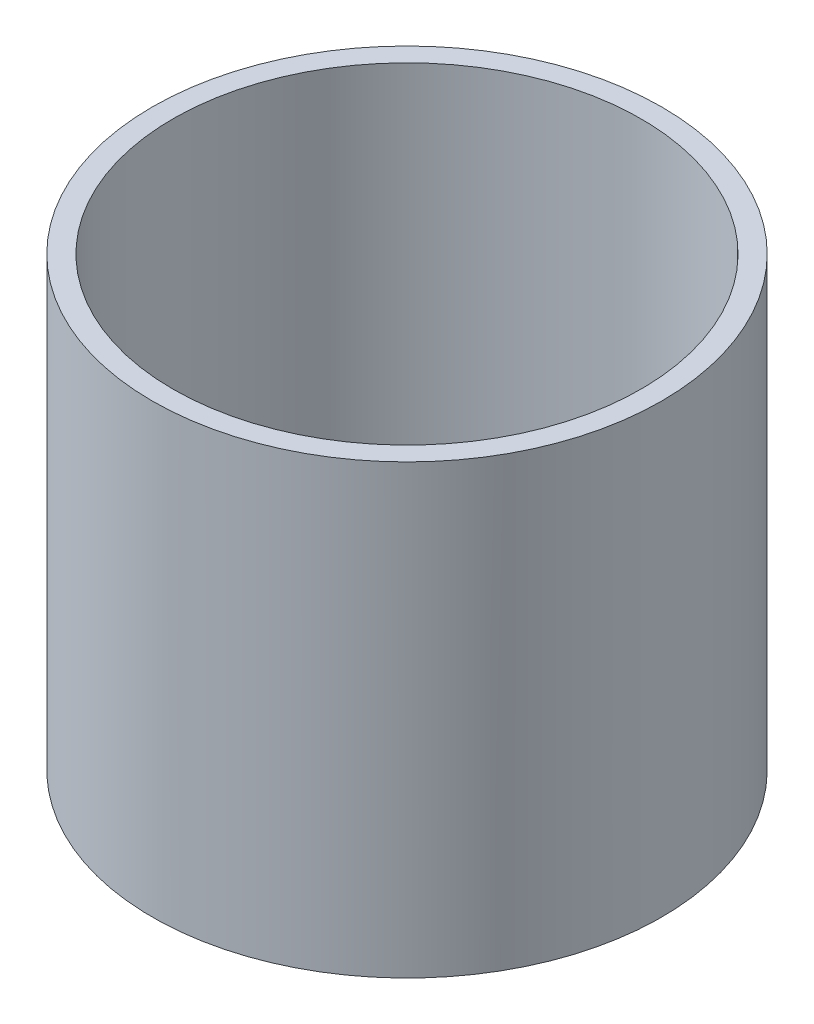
ISO-10303-21;
HEADER;
FILE_DESCRIPTION(('STEP AP214'),'2;1');
FILE_NAME('part.step','',(''),(''),'','','');
FILE_SCHEMA(('AUTOMOTIVE_DESIGN { 1 0 10303 214 1 1 1 1 }'));
ENDSEC;
DATA;
#1=APPLICATION_CONTEXT('core data for automotive mechanical design processes');
#2=APPLICATION_PROTOCOL_DEFINITION('international standard','automotive_design',2000,#1);
#3=PRODUCT_CONTEXT('',#1,'mechanical');
#4=PRODUCT('Part','Part','',(#3));
#5=PRODUCT_RELATED_PRODUCT_CATEGORY('part','',(#4));
#6=PRODUCT_DEFINITION_FORMATION('','',#4);
#7=PRODUCT_DEFINITION_CONTEXT('part definition',#1,'design');
#8=PRODUCT_DEFINITION('design','',#6,#7);
#9=PRODUCT_DEFINITION_SHAPE('','',#8);
#10=(LENGTH_UNIT() NAMED_UNIT(*) SI_UNIT(.MILLI.,.METRE.));
#11=(NAMED_UNIT(*) PLANE_ANGLE_UNIT() SI_UNIT($,.RADIAN.));
#12=(NAMED_UNIT(*) SI_UNIT($,.STERADIAN.) SOLID_ANGLE_UNIT());
#13=UNCERTAINTY_MEASURE_WITH_UNIT(LENGTH_MEASURE(1.E-05),#10,'distance_accuracy_value','');
#14=(GEOMETRIC_REPRESENTATION_CONTEXT(3) GLOBAL_UNCERTAINTY_ASSIGNED_CONTEXT((#13)) GLOBAL_UNIT_ASSIGNED_CONTEXT((#10,
#11,#12)) REPRESENTATION_CONTEXT('',''));
#15=CARTESIAN_POINT('',(0.,0.,0.));
#16=DIRECTION('',(0.,0.,1.));
#17=DIRECTION('',(1.,0.,0.));
#18=AXIS2_PLACEMENT_3D('',#15,#16,#17);
#19=CARTESIAN_POINT('',(0.,7.8232,0.));
#20=DIRECTION('',(0.,-1.,0.));
#21=DIRECTION('',(0.,0.,-1.));
#22=AXIS2_PLACEMENT_3D('',#19,#20,#21);
#23=CYLINDRICAL_SURFACE('',#22,5.1816);
#24=CARTESIAN_POINT('',(0.,7.8232,0.));
#25=DIRECTION('',(0.,1.,0.));
#26=DIRECTION('',(0.,0.,1.));
#27=AXIS2_PLACEMENT_3D('',#24,#25,#26);
#28=CIRCLE('',#27,5.1816);
#29=CARTESIAN_POINT('',(0.,7.8232,5.1816));
#30=VERTEX_POINT('',#29);
#31=EDGE_CURVE('E10',#30,#30,#28,.T.);
#32=ORIENTED_EDGE('',*,*,#31,.F.);
#33=EDGE_LOOP('',(#32));
#34=FACE_BOUND('',#33,.T.);
#35=CARTESIAN_POINT('',(0.,-1.27,0.));
#36=DIRECTION('',(0.,-1.,0.));
#37=DIRECTION('',(0.,0.,-1.));
#38=AXIS2_PLACEMENT_3D('',#35,#36,#37);
#39=CIRCLE('',#38,5.1816);
#40=CARTESIAN_POINT('',(0.,-1.27,-5.1816));
#41=VERTEX_POINT('',#40);
#42=EDGE_CURVE('E50',#41,#41,#39,.T.);
#43=ORIENTED_EDGE('',*,*,#42,.F.);
#44=EDGE_LOOP('',(#43));
#45=FACE_BOUND('',#44,.T.);
#46=ADVANCED_FACE('F31',(#34,#45),#23,.T.);
#47=CARTESIAN_POINT('',(0.,7.8232,0.));
#48=DIRECTION('',(0.,1.,0.));
#49=DIRECTION('',(0.,0.,1.));
#50=AXIS2_PLACEMENT_3D('',#47,#48,#49);
#51=PLANE('',#50);
#52=CARTESIAN_POINT('',(0.,7.8232,0.));
#53=DIRECTION('',(0.,1.,0.));
#54=DIRECTION('',(0.,0.,1.));
#55=AXIS2_PLACEMENT_3D('',#52,#53,#54);
#56=CIRCLE('',#55,4.7625);
#57=CARTESIAN_POINT('',(0.,7.8232,4.7625));
#58=VERTEX_POINT('',#57);
#59=EDGE_CURVE('E41',#58,#58,#56,.T.);
#60=ORIENTED_EDGE('',*,*,#59,.F.);
#61=EDGE_LOOP('',(#60));
#62=FACE_BOUND('',#61,.T.);
#63=ORIENTED_EDGE('',*,*,#31,.T.);
#64=EDGE_LOOP('',(#63));
#65=FACE_BOUND('',#64,.T.);
#66=ADVANCED_FACE('F68',(#62,#65),#51,.T.);
#67=CARTESIAN_POINT('',(0.,0.838199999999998,0.));
#68=DIRECTION('',(0.,1.,0.));
#69=DIRECTION('',(0.,0.,1.));
#70=AXIS2_PLACEMENT_3D('',#67,#68,#69);
#71=CYLINDRICAL_SURFACE('',#70,4.7625);
#72=CARTESIAN_POINT('',(0.,0.838199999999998,0.));
#73=DIRECTION('',(0.,1.,0.));
#74=DIRECTION('',(0.,0.,1.));
#75=AXIS2_PLACEMENT_3D('',#72,#73,#74);
#76=CIRCLE('',#75,4.7625);
#77=CARTESIAN_POINT('',(0.,0.838199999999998,4.7625));
#78=VERTEX_POINT('',#77);
#79=EDGE_CURVE('E37',#78,#78,#76,.T.);
#80=ORIENTED_EDGE('',*,*,#79,.F.);
#81=EDGE_LOOP('',(#80));
#82=FACE_BOUND('',#81,.T.);
#83=ORIENTED_EDGE('',*,*,#59,.T.);
#84=EDGE_LOOP('',(#83));
#85=FACE_BOUND('',#84,.T.);
#86=ADVANCED_FACE('F73',(#82,#85),#71,.F.);
#87=CARTESIAN_POINT('',(0.,0.838199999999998,0.));
#88=DIRECTION('',(0.,1.,0.));
#89=DIRECTION('',(0.,0.,1.));
#90=AXIS2_PLACEMENT_3D('',#87,#88,#89);
#91=PLANE('',#90);
#92=ORIENTED_EDGE('',*,*,#79,.T.);
#93=EDGE_LOOP('',(#92));
#94=FACE_BOUND('',#93,.T.);
#95=ADVANCED_FACE('F63',(#94),#91,.T.);
#96=CARTESIAN_POINT('',(0.,-1.27,0.));
#97=DIRECTION('',(0.,-1.,0.));
#98=DIRECTION('',(0.,0.,-1.));
#99=AXIS2_PLACEMENT_3D('',#96,#97,#98);
#100=PLANE('',#99);
#101=CARTESIAN_POINT('',(0.,-1.27,0.));
#102=DIRECTION('',(0.,-1.,0.));
#103=DIRECTION('',(0.,0.,-1.));
#104=AXIS2_PLACEMENT_3D('',#101,#102,#103);
#105=CIRCLE('',#104,4.0259);
#106=CARTESIAN_POINT('',(0.,-1.27,-4.0259));
#107=VERTEX_POINT('',#106);
#108=EDGE_CURVE('E53',#107,#107,#105,.T.);
#109=ORIENTED_EDGE('',*,*,#108,.F.);
#110=EDGE_LOOP('',(#109));
#111=FACE_BOUND('',#110,.T.);
#112=ORIENTED_EDGE('',*,*,#42,.T.);
#113=EDGE_LOOP('',(#112));
#114=FACE_BOUND('',#113,.T.);
#115=ADVANCED_FACE('F59',(#111,#114),#100,.T.);
#116=CARTESIAN_POINT('',(0.,0.508,0.));
#117=DIRECTION('',(0.,-1.,0.));
#118=DIRECTION('',(0.,0.,-1.));
#119=AXIS2_PLACEMENT_3D('',#116,#117,#118);
#120=PLANE('',#119);
#121=CARTESIAN_POINT('',(0.,0.508,0.));
#122=DIRECTION('',(0.,-1.,0.));
#123=DIRECTION('',(0.,0.,-1.));
#124=AXIS2_PLACEMENT_3D('',#121,#122,#123);
#125=CIRCLE('',#124,4.0259);
#126=CARTESIAN_POINT('',(0.,0.508,-4.0259));
#127=VERTEX_POINT('',#126);
#128=EDGE_CURVE('E46',#127,#127,#125,.T.);
#129=ORIENTED_EDGE('',*,*,#128,.T.);
#130=EDGE_LOOP('',(#129));
#131=FACE_BOUND('',#130,.T.);
#132=ADVANCED_FACE('F62',(#131),#120,.T.);
#133=CARTESIAN_POINT('',(0.,0.508,0.));
#134=DIRECTION('',(0.,-1.,0.));
#135=DIRECTION('',(0.,0.,-1.));
#136=AXIS2_PLACEMENT_3D('',#133,#134,#135);
#137=CYLINDRICAL_SURFACE('',#136,4.0259);
#138=ORIENTED_EDGE('',*,*,#128,.F.);
#139=EDGE_LOOP('',(#138));
#140=FACE_BOUND('',#139,.T.);
#141=ORIENTED_EDGE('',*,*,#108,.T.);
#142=EDGE_LOOP('',(#141));
#143=FACE_BOUND('',#142,.T.);
#144=ADVANCED_FACE('F57',(#140,#143),#137,.F.);
#145=CLOSED_SHELL('',(#46,#66,#86,#95,#115,#132,#144));
#146=MANIFOLD_SOLID_BREP('B2',#145);
#147=ADVANCED_BREP_SHAPE_REPRESENTATION('',(#18,#146),#14);
#148=SHAPE_DEFINITION_REPRESENTATION(#9,#147);
ENDSEC;
END-ISO-10303-21;
